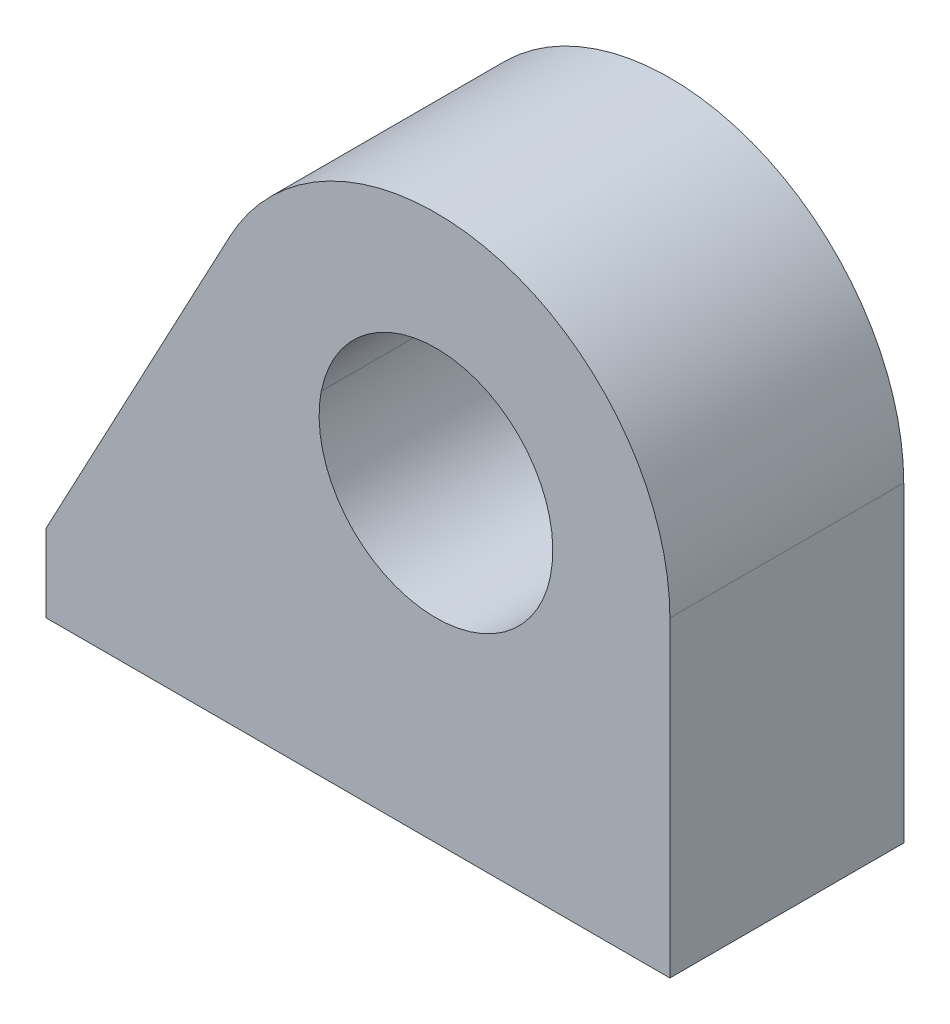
ISO-10303-21;
HEADER;
FILE_DESCRIPTION(('STEP AP214'),'2;1');
FILE_NAME('part.step','',(''),(''),'','','');
FILE_SCHEMA(('AUTOMOTIVE_DESIGN { 1 0 10303 214 1 1 1 1 }'));
ENDSEC;
DATA;
#1=APPLICATION_CONTEXT('core data for automotive mechanical design processes');
#2=APPLICATION_PROTOCOL_DEFINITION('international standard','automotive_design',2000,#1);
#3=PRODUCT_CONTEXT('',#1,'mechanical');
#4=PRODUCT('Part','Part','',(#3));
#5=PRODUCT_RELATED_PRODUCT_CATEGORY('part','',(#4));
#6=PRODUCT_DEFINITION_FORMATION('','',#4);
#7=PRODUCT_DEFINITION_CONTEXT('part definition',#1,'design');
#8=PRODUCT_DEFINITION('design','',#6,#7);
#9=PRODUCT_DEFINITION_SHAPE('','',#8);
#10=(LENGTH_UNIT() NAMED_UNIT(*) SI_UNIT(.MILLI.,.METRE.));
#11=(NAMED_UNIT(*) PLANE_ANGLE_UNIT() SI_UNIT($,.RADIAN.));
#12=(NAMED_UNIT(*) SI_UNIT($,.STERADIAN.) SOLID_ANGLE_UNIT());
#13=UNCERTAINTY_MEASURE_WITH_UNIT(LENGTH_MEASURE(1.E-05),#10,'distance_accuracy_value','');
#14=(GEOMETRIC_REPRESENTATION_CONTEXT(3) GLOBAL_UNCERTAINTY_ASSIGNED_CONTEXT((#13)) GLOBAL_UNIT_ASSIGNED_CONTEXT((#10,
#11,#12)) REPRESENTATION_CONTEXT('',''));
#15=CARTESIAN_POINT('',(0.,0.,0.));
#16=DIRECTION('',(0.,0.,1.));
#17=DIRECTION('',(1.,0.,0.));
#18=AXIS2_PLACEMENT_3D('',#15,#16,#17);
#19=CARTESIAN_POINT('',(-640.,305.,-7.5));
#20=DIRECTION('',(-1.,0.,0.));
#21=DIRECTION('',(0.,-1.,0.));
#22=AXIS2_PLACEMENT_3D('',#19,#20,#21);
#23=PLANE('',#22);
#24=DIRECTION('',(0.,0.,1.));
#25=VECTOR('',#24,1.);
#26=CARTESIAN_POINT('',(-640.,305.,-7.5));
#27=LINE('',#26,#25);
#28=CARTESIAN_POINT('',(-640.,305.,-7.5));
#29=VERTEX_POINT('',#28);
#30=CARTESIAN_POINT('',(-640.,305.,7.5));
#31=VERTEX_POINT('',#30);
#32=EDGE_CURVE('E36',#29,#31,#27,.T.);
#33=ORIENTED_EDGE('',*,*,#32,.T.);
#34=DIRECTION('',(0.,-1.,0.));
#35=VECTOR('',#34,1.);
#36=CARTESIAN_POINT('',(-640.,305.,7.5));
#37=LINE('',#36,#35);
#38=CARTESIAN_POINT('',(-640.,310.,7.5));
#39=VERTEX_POINT('',#38);
#40=EDGE_CURVE('E143',#39,#31,#37,.T.);
#41=ORIENTED_EDGE('',*,*,#40,.F.);
#42=DIRECTION('',(0.,0.,1.));
#43=VECTOR('',#42,1.);
#44=CARTESIAN_POINT('',(-640.,310.,-7.5));
#45=LINE('',#44,#43);
#46=CARTESIAN_POINT('',(-640.,310.,-7.5));
#47=VERTEX_POINT('',#46);
#48=EDGE_CURVE('E11',#47,#39,#45,.T.);
#49=ORIENTED_EDGE('',*,*,#48,.F.);
#50=DIRECTION('',(0.,-1.,0.));
#51=VECTOR('',#50,1.);
#52=CARTESIAN_POINT('',(-640.,305.,-7.5));
#53=LINE('',#52,#51);
#54=EDGE_CURVE('E160',#47,#29,#53,.T.);
#55=ORIENTED_EDGE('',*,*,#54,.T.);
#56=EDGE_LOOP('',(#33,#41,#49,#55));
#57=FACE_BOUND('',#56,.T.);
#58=ADVANCED_FACE('F33',(#57),#23,.T.);
#59=CARTESIAN_POINT('',(-640.,310.,-7.5));
#60=DIRECTION('',(-0.882352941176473,0.470588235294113,0.));
#61=DIRECTION('',(-0.470588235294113,-0.882352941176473,0.));
#62=AXIS2_PLACEMENT_3D('',#59,#60,#61);
#63=PLANE('',#62);
#64=ORIENTED_EDGE('',*,*,#48,.T.);
#65=DIRECTION('',(-0.470588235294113,-0.882352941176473,0.));
#66=VECTOR('',#65,1.);
#67=CARTESIAN_POINT('',(-640.,310.,7.5));
#68=LINE('',#67,#66);
#69=CARTESIAN_POINT('',(-628.235294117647,332.058823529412,7.5));
#70=VERTEX_POINT('',#69);
#71=EDGE_CURVE('E155',#70,#39,#68,.T.);
#72=ORIENTED_EDGE('',*,*,#71,.F.);
#73=DIRECTION('',(0.,0.,1.));
#74=VECTOR('',#73,1.);
#75=CARTESIAN_POINT('',(-628.235294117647,332.058823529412,-7.5));
#76=LINE('',#75,#74);
#77=CARTESIAN_POINT('',(-628.235294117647,332.058823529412,-7.5));
#78=VERTEX_POINT('',#77);
#79=EDGE_CURVE('E41',#78,#70,#76,.T.);
#80=ORIENTED_EDGE('',*,*,#79,.F.);
#81=DIRECTION('',(-0.470588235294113,-0.882352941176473,0.));
#82=VECTOR('',#81,1.);
#83=CARTESIAN_POINT('',(-640.,310.,-7.5));
#84=LINE('',#83,#82);
#85=EDGE_CURVE('E171',#78,#47,#84,.T.);
#86=ORIENTED_EDGE('',*,*,#85,.T.);
#87=EDGE_LOOP('',(#64,#72,#80,#86));
#88=FACE_BOUND('',#87,.T.);
#89=ADVANCED_FACE('F185',(#88),#63,.T.);
#90=CARTESIAN_POINT('',(-615.,325.,-7.5));
#91=DIRECTION('',(0.,0.,1.));
#92=DIRECTION('',(1.,0.,0.));
#93=AXIS2_PLACEMENT_3D('',#90,#91,#92);
#94=CYLINDRICAL_SURFACE('',#93,15.);
#95=ORIENTED_EDGE('',*,*,#79,.T.);
#96=CARTESIAN_POINT('',(-615.,325.,7.5));
#97=DIRECTION('',(0.,0.,1.));
#98=DIRECTION('',(1.,0.,0.));
#99=AXIS2_PLACEMENT_3D('',#96,#97,#98);
#100=CIRCLE('',#99,15.);
#101=CARTESIAN_POINT('',(-600.,325.,7.5));
#102=VERTEX_POINT('',#101);
#103=EDGE_CURVE('E152',#102,#70,#100,.T.);
#104=ORIENTED_EDGE('',*,*,#103,.F.);
#105=DIRECTION('',(0.,0.,1.));
#106=VECTOR('',#105,1.);
#107=CARTESIAN_POINT('',(-600.,325.,-7.5));
#108=LINE('',#107,#106);
#109=CARTESIAN_POINT('',(-600.,325.,-7.5));
#110=VERTEX_POINT('',#109);
#111=EDGE_CURVE('E175',#110,#102,#108,.T.);
#112=ORIENTED_EDGE('',*,*,#111,.F.);
#113=CARTESIAN_POINT('',(-615.,325.,-7.5));
#114=DIRECTION('',(0.,0.,1.));
#115=DIRECTION('',(1.,0.,0.));
#116=AXIS2_PLACEMENT_3D('',#113,#114,#115);
#117=CIRCLE('',#116,15.);
#118=EDGE_CURVE('E168',#110,#78,#117,.T.);
#119=ORIENTED_EDGE('',*,*,#118,.T.);
#120=EDGE_LOOP('',(#95,#104,#112,#119));
#121=FACE_BOUND('',#120,.T.);
#122=ADVANCED_FACE('F194',(#121),#94,.T.);
#123=CARTESIAN_POINT('',(-600.,305.,-7.5));
#124=DIRECTION('',(1.,0.,0.));
#125=DIRECTION('',(0.,1.,0.));
#126=AXIS2_PLACEMENT_3D('',#123,#124,#125);
#127=PLANE('',#126);
#128=ORIENTED_EDGE('',*,*,#111,.T.);
#129=DIRECTION('',(0.,1.,0.));
#130=VECTOR('',#129,1.);
#131=CARTESIAN_POINT('',(-600.,305.,7.5));
#132=LINE('',#131,#130);
#133=CARTESIAN_POINT('',(-600.,305.,7.5));
#134=VERTEX_POINT('',#133);
#135=EDGE_CURVE('E149',#134,#102,#132,.T.);
#136=ORIENTED_EDGE('',*,*,#135,.F.);
#137=DIRECTION('',(0.,0.,1.));
#138=VECTOR('',#137,1.);
#139=CARTESIAN_POINT('',(-600.,305.,-7.5));
#140=LINE('',#139,#138);
#141=CARTESIAN_POINT('',(-600.,305.,-7.5));
#142=VERTEX_POINT('',#141);
#143=EDGE_CURVE('E176',#142,#134,#140,.T.);
#144=ORIENTED_EDGE('',*,*,#143,.F.);
#145=DIRECTION('',(0.,1.,0.));
#146=VECTOR('',#145,1.);
#147=CARTESIAN_POINT('',(-600.,305.,-7.5));
#148=LINE('',#147,#146);
#149=EDGE_CURVE('E165',#142,#110,#148,.T.);
#150=ORIENTED_EDGE('',*,*,#149,.T.);
#151=EDGE_LOOP('',(#128,#136,#144,#150));
#152=FACE_BOUND('',#151,.T.);
#153=ADVANCED_FACE('F192',(#152),#127,.T.);
#154=CARTESIAN_POINT('',(-640.,305.,-7.5));
#155=DIRECTION('',(0.,-1.,0.));
#156=DIRECTION('',(0.,0.,-1.));
#157=AXIS2_PLACEMENT_3D('',#154,#155,#156);
#158=PLANE('',#157);
#159=ORIENTED_EDGE('',*,*,#143,.T.);
#160=DIRECTION('',(1.,0.,0.));
#161=VECTOR('',#160,1.);
#162=CARTESIAN_POINT('',(-640.,305.,7.5));
#163=LINE('',#162,#161);
#164=EDGE_CURVE('E146',#31,#134,#163,.T.);
#165=ORIENTED_EDGE('',*,*,#164,.F.);
#166=ORIENTED_EDGE('',*,*,#32,.F.);
#167=DIRECTION('',(1.,0.,0.));
#168=VECTOR('',#167,1.);
#169=CARTESIAN_POINT('',(-640.,305.,-7.5));
#170=LINE('',#169,#168);
#171=EDGE_CURVE('E162',#29,#142,#170,.T.);
#172=ORIENTED_EDGE('',*,*,#171,.T.);
#173=EDGE_LOOP('',(#159,#165,#166,#172));
#174=FACE_BOUND('',#173,.T.);
#175=ADVANCED_FACE('F180',(#174),#158,.T.);
#176=CARTESIAN_POINT('',(-615.,325.,-7.5));
#177=DIRECTION('',(0.,0.,1.));
#178=DIRECTION('',(1.,0.,0.));
#179=AXIS2_PLACEMENT_3D('',#176,#177,#178);
#180=PLANE('',#179);
#181=DIRECTION('',(-0.981627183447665,0.190808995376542,0.));
#182=VECTOR('',#181,1.);
#183=CARTESIAN_POINT('',(-622.352387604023,326.42915937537,-7.5));
#184=LINE('',#183,#182);
#185=CARTESIAN_POINT('',(-622.352387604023,326.42915937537,-7.5));
#186=VERTEX_POINT('',#185);
#187=CARTESIAN_POINT('',(-622.362203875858,326.431067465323,-7.5));
#188=VERTEX_POINT('',#187);
#189=EDGE_CURVE('E49',#186,#188,#184,.T.);
#190=ORIENTED_EDGE('',*,*,#189,.T.);
#191=CARTESIAN_POINT('',(-615.,325.,-7.5));
#192=DIRECTION('',(0.,0.,1.));
#193=DIRECTION('',(1.,0.,0.));
#194=AXIS2_PLACEMENT_3D('',#191,#192,#193);
#195=CIRCLE('',#194,7.49999999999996);
#196=CARTESIAN_POINT('',(-607.637796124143,323.568932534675,-7.5));
#197=VERTEX_POINT('',#196);
#198=EDGE_CURVE('E158',#188,#197,#195,.T.);
#199=ORIENTED_EDGE('',*,*,#198,.T.);
#200=DIRECTION('',(-0.981627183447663,0.190808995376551,0.));
#201=VECTOR('',#200,1.);
#202=CARTESIAN_POINT('',(-603.653325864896,322.794429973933,-7.5));
#203=LINE('',#202,#201);
#204=CARTESIAN_POINT('',(-607.647612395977,323.570840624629,-7.5));
#205=VERTEX_POINT('',#204);
#206=EDGE_CURVE('E135',#197,#205,#203,.T.);
#207=ORIENTED_EDGE('',*,*,#206,.T.);
#208=CARTESIAN_POINT('',(-615.,325.,-7.5));
#209=DIRECTION('',(0.,0.,1.));
#210=DIRECTION('',(1.,0.,0.));
#211=AXIS2_PLACEMENT_3D('',#208,#209,#210);
#212=CIRCLE('',#211,7.49);
#213=EDGE_CURVE('E112',#205,#186,#212,.T.);
#214=ORIENTED_EDGE('',*,*,#213,.T.);
#215=EDGE_LOOP('',(#190,#199,#207,#214));
#216=FACE_BOUND('',#215,.T.);
#217=ORIENTED_EDGE('',*,*,#54,.F.);
#218=ORIENTED_EDGE('',*,*,#85,.F.);
#219=ORIENTED_EDGE('',*,*,#118,.F.);
#220=ORIENTED_EDGE('',*,*,#149,.F.);
#221=ORIENTED_EDGE('',*,*,#171,.F.);
#222=EDGE_LOOP('',(#217,#218,#219,#220,#221));
#223=FACE_BOUND('',#222,.T.);
#224=ADVANCED_FACE('F189',(#216,#223),#180,.F.);
#225=CARTESIAN_POINT('',(-615.,325.,-7.5));
#226=DIRECTION('',(0.,0.,1.));
#227=DIRECTION('',(1.,0.,0.));
#228=AXIS2_PLACEMENT_3D('',#225,#226,#227);
#229=CYLINDRICAL_SURFACE('',#228,7.49999999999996);
#230=ORIENTED_EDGE('',*,*,#198,.F.);
#231=DIRECTION('',(0.,0.,1.));
#232=VECTOR('',#231,1.);
#233=CARTESIAN_POINT('',(-622.362203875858,326.431067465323,-7.5));
#234=LINE('',#233,#232);
#235=CARTESIAN_POINT('',(-622.362203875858,326.431067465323,7.5));
#236=VERTEX_POINT('',#235);
#237=EDGE_CURVE('E138',#188,#236,#234,.T.);
#238=ORIENTED_EDGE('',*,*,#237,.T.);
#239=CARTESIAN_POINT('',(-615.,325.,7.5));
#240=DIRECTION('',(0.,0.,1.));
#241=DIRECTION('',(1.,0.,0.));
#242=AXIS2_PLACEMENT_3D('',#239,#240,#241);
#243=CIRCLE('',#242,7.49999999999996);
#244=CARTESIAN_POINT('',(-607.637796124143,323.568932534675,7.5));
#245=VERTEX_POINT('',#244);
#246=EDGE_CURVE('E141',#236,#245,#243,.T.);
#247=ORIENTED_EDGE('',*,*,#246,.T.);
#248=DIRECTION('',(0.,0.,1.));
#249=VECTOR('',#248,1.);
#250=CARTESIAN_POINT('',(-607.637796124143,323.568932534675,-7.5));
#251=LINE('',#250,#249);
#252=EDGE_CURVE('E121',#245,#197,#251,.F.);
#253=ORIENTED_EDGE('',*,*,#252,.T.);
#254=EDGE_LOOP('',(#230,#238,#247,#253));
#255=FACE_BOUND('',#254,.T.);
#256=ADVANCED_FACE('F239',(#255),#229,.F.);
#257=CARTESIAN_POINT('',(-615.,325.,7.5));
#258=DIRECTION('',(0.,0.,1.));
#259=DIRECTION('',(1.,0.,0.));
#260=AXIS2_PLACEMENT_3D('',#257,#258,#259);
#261=PLANE('',#260);
#262=ORIENTED_EDGE('',*,*,#246,.F.);
#263=DIRECTION('',(0.981627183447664,-0.190808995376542,0.));
#264=VECTOR('',#263,1.);
#265=CARTESIAN_POINT('',(-622.352387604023,326.42915937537,7.5));
#266=LINE('',#265,#264);
#267=CARTESIAN_POINT('',(-622.352387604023,326.42915937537,7.5));
#268=VERTEX_POINT('',#267);
#269=EDGE_CURVE('E115',#236,#268,#266,.T.);
#270=ORIENTED_EDGE('',*,*,#269,.T.);
#271=CARTESIAN_POINT('',(-615.,325.,7.5));
#272=DIRECTION('',(0.,0.,-1.));
#273=DIRECTION('',(1.,0.,0.));
#274=AXIS2_PLACEMENT_3D('',#271,#272,#273);
#275=CIRCLE('',#274,7.49);
#276=CARTESIAN_POINT('',(-607.647612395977,323.570840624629,7.5));
#277=VERTEX_POINT('',#276);
#278=EDGE_CURVE('E111',#268,#277,#275,.T.);
#279=ORIENTED_EDGE('',*,*,#278,.T.);
#280=DIRECTION('',(0.981627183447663,-0.190808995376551,0.));
#281=VECTOR('',#280,1.);
#282=CARTESIAN_POINT('',(-603.653325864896,322.794429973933,7.5));
#283=LINE('',#282,#281);
#284=EDGE_CURVE('E118',#277,#245,#283,.T.);
#285=ORIENTED_EDGE('',*,*,#284,.T.);
#286=EDGE_LOOP('',(#262,#270,#279,#285));
#287=FACE_BOUND('',#286,.T.);
#288=ORIENTED_EDGE('',*,*,#40,.T.);
#289=ORIENTED_EDGE('',*,*,#164,.T.);
#290=ORIENTED_EDGE('',*,*,#135,.T.);
#291=ORIENTED_EDGE('',*,*,#103,.T.);
#292=ORIENTED_EDGE('',*,*,#71,.T.);
#293=EDGE_LOOP('',(#288,#289,#290,#291,#292));
#294=FACE_BOUND('',#293,.T.);
#295=ADVANCED_FACE('F126',(#287,#294),#261,.T.);
#296=CARTESIAN_POINT('',(-622.352387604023,326.42915937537,-33.9158694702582));
#297=DIRECTION('',(-0.190808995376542,-0.981627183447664,0.));
#298=DIRECTION('',(0.981627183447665,-0.190808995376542,0.));
#299=AXIS2_PLACEMENT_3D('',#296,#297,#298);
#300=PLANE('',#299);
#301=ORIENTED_EDGE('',*,*,#237,.F.);
#302=ORIENTED_EDGE('',*,*,#189,.F.);
#303=DIRECTION('',(0.,0.,1.));
#304=VECTOR('',#303,1.);
#305=CARTESIAN_POINT('',(-622.352387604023,326.42915937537,-33.9158694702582));
#306=LINE('',#305,#304);
#307=EDGE_CURVE('E114',#186,#268,#306,.T.);
#308=ORIENTED_EDGE('',*,*,#307,.T.);
#309=ORIENTED_EDGE('',*,*,#269,.F.);
#310=EDGE_LOOP('',(#301,#302,#308,#309));
#311=FACE_BOUND('',#310,.T.);
#312=ADVANCED_FACE('F258',(#311),#300,.T.);
#313=CARTESIAN_POINT('',(-603.653325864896,322.794429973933,-33.9158694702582));
#314=DIRECTION('',(-0.190808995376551,-0.981627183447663,0.));
#315=DIRECTION('',(0.981627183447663,-0.190808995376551,0.));
#316=AXIS2_PLACEMENT_3D('',#313,#314,#315);
#317=PLANE('',#316);
#318=ORIENTED_EDGE('',*,*,#252,.F.);
#319=ORIENTED_EDGE('',*,*,#284,.F.);
#320=DIRECTION('',(0.,0.,1.));
#321=VECTOR('',#320,1.);
#322=CARTESIAN_POINT('',(-607.647612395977,323.570840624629,-33.9158694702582));
#323=LINE('',#322,#321);
#324=EDGE_CURVE('E106',#205,#277,#323,.T.);
#325=ORIENTED_EDGE('',*,*,#324,.F.);
#326=ORIENTED_EDGE('',*,*,#206,.F.);
#327=EDGE_LOOP('',(#318,#319,#325,#326));
#328=FACE_BOUND('',#327,.T.);
#329=ADVANCED_FACE('F119',(#328),#317,.T.);
#330=CARTESIAN_POINT('',(-615.,325.,-33.9158694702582));
#331=DIRECTION('',(0.,0.,1.));
#332=DIRECTION('',(1.,0.,0.));
#333=AXIS2_PLACEMENT_3D('',#330,#331,#332);
#334=CYLINDRICAL_SURFACE('',#333,7.49);
#335=ORIENTED_EDGE('',*,*,#213,.F.);
#336=ORIENTED_EDGE('',*,*,#324,.T.);
#337=ORIENTED_EDGE('',*,*,#278,.F.);
#338=ORIENTED_EDGE('',*,*,#307,.F.);
#339=EDGE_LOOP('',(#335,#336,#337,#338));
#340=FACE_BOUND('',#339,.T.);
#341=ADVANCED_FACE('F108',(#340),#334,.F.);
#342=CLOSED_SHELL('',(#58,#89,#122,#153,#175,#224,#256,#295,#312,#329,#341));
#343=MANIFOLD_SOLID_BREP('B2',#342);
#344=ADVANCED_BREP_SHAPE_REPRESENTATION('',(#18,#343),#14);
#345=SHAPE_DEFINITION_REPRESENTATION(#9,#344);
ENDSEC;
END-ISO-10303-21;
